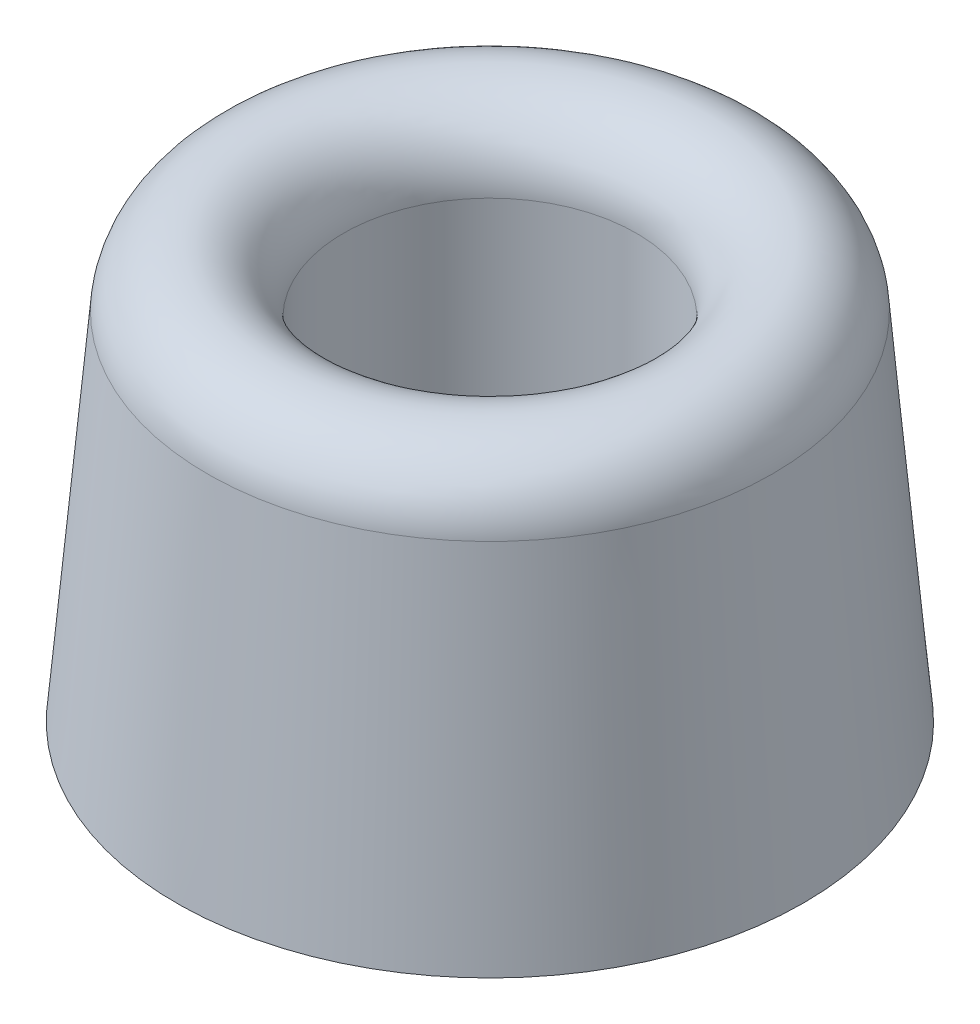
from build123d import *


with BuildPart() as part:
    # Sketch2 → Revolve1 (revolve)
    with BuildSketch(Plane.XY, mode=Mode.PRIVATE) as revolve1_sk:
        with BuildLine():
            Line((-5.55625, 0), (-2.778125, 0))
            Line((-2.778125, 0), (-2.778125, -4.7625))
            Line((-2.778125, -4.7625), (-11.90625, -4.7625))
            Line((-11.90625, -4.7625), (-10.72412313, 8.749271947))
            ThreePointArc((-10.72412313, 8.749271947), (-8.03218768, 11.110035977), (-5.55625, 8.523637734))
            Line((-5.55625, 8.523637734), (-5.55625, 0))
        make_face()
    revolve(revolve1_sk.sketch.rotate(Axis((0, -4.7625, 0), (0, 1, 0)), 180), axis=Axis((0, -4.7625, 0), (0, 1, 0)))


solid = part.part
